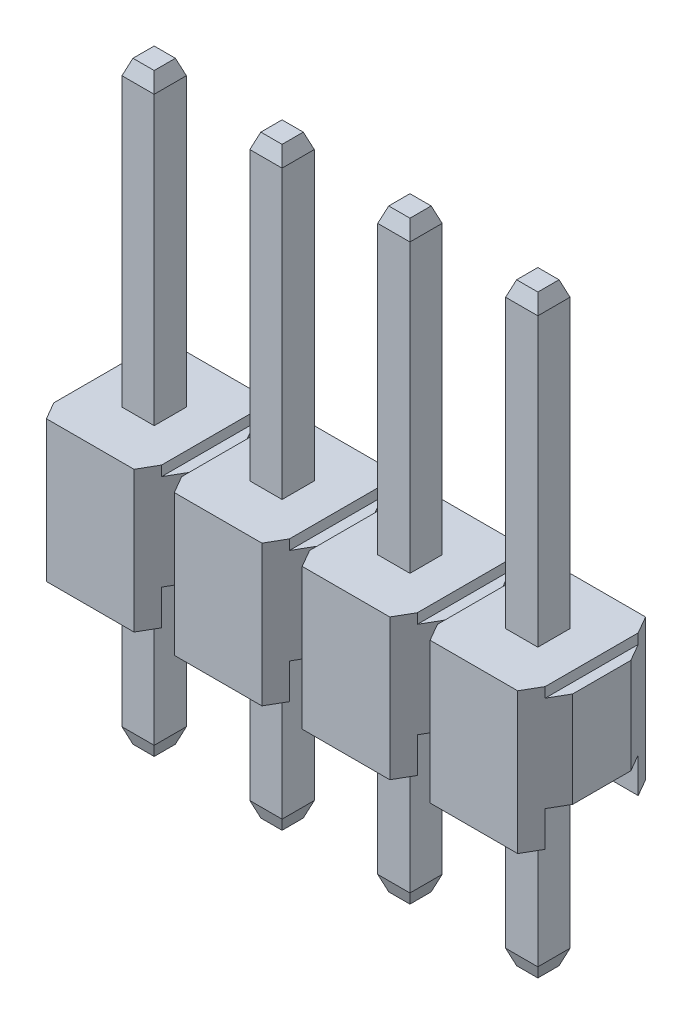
from build123d import *
from OCP.BRepFilletAPI import BRepFilletAPI_MakeChamfer

# Parameters (mm, degrees)
EXTRUDE_2_DEPTH                     = 2.8
SKETCH_3_W                          = 1.847179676
SKETCH_3_H                          = 0.7
CUT_EXTRUDE_1_DEPTH                 = 1.27
SKETCH_4_W                          = 0.2
SKETCH_4_H                          = 0.2
CUT_EXTRUDE_2_DEPTH                 = 4.326529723
EXTRUDE_START                       = -3
SKETCH_1_W                          = 0.64
SKETCH_1_H                          = 0.64
EXTRUDE_1_DEPTH                     = 11.8
CHAMFER_1_SIZE                      = 0.3
CHAMFER_1_SIZE2                     = 0.10919107
CHAMFER_2_SIZE                      = 0.11
CHAMFER_2_SIZE2                     = 0.302222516
PATTERN_LINEAR_1_COUNT              = 4
PATTERN_LINEAR_1_PITCH              = 2.54
PATTERN_LINEAR_2_COUNT              = 100
PATTERN_LINEAR_2_PITCH              = 2.54
CHAMFER_1_OF_PATTERN_LINEAR_2_SIZE  = 0.3
CHAMFER_1_OF_PATTERN_LINEAR_2_SIZE2 = 0.10919107
CHAMFER_2_OF_PATTERN_LINEAR_2_SIZE2 = 0.11
CHAMFER_2_OF_PATTERN_LINEAR_2_SIZE  = 0.302222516


with BuildPart() as part:
    # Sketch 2 → Extrude 2 (new body)
    with BuildSketch(Plane(origin=(0, 0, 0), x_dir=(1, 0, 0), z_dir=(0, 1, 0))):
        Polygon((-1.27, 0.577179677), (-0.87, 1.27), (0.87, 1.27), (1.27, 0.577179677), (1.27, -0.577179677), (0.87, -1.27), (-0.87, -1.27), (-1.27, -0.577179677), align=None)
    extrude_2 = extrude(amount=EXTRUDE_2_DEPTH)

    # Sketch 3 → Cut-Extrude 1 (cut, symmetric)
    with BuildSketch(Plane(origin=(0, 0, 0), x_dir=(0, 0, -1), z_dir=(1, 0, 0))):
        with Locations((0, 0.35)):
            Rectangle(SKETCH_3_W, SKETCH_3_H)
    cut_extrude_1 = extrude(amount=CUT_EXTRUDE_1_DEPTH, both=True, mode=Mode.SUBTRACT)

    # Sketch 4 → Cut-Extrude 2 (cut, symmetric)
    with BuildSketch(Plane.XY):
        with Locations((-1.17, 2.7)):
            Rectangle(SKETCH_4_W, SKETCH_4_H)
        with Locations((1.17, 2.7)):
            Rectangle(SKETCH_4_W, SKETCH_4_H)
    cut_extrude_2 = extrude(amount=CUT_EXTRUDE_2_DEPTH, both=True, mode=Mode.SUBTRACT)

    # Sketch 1 → Extrude 1 (add)
    with BuildSketch(Plane(origin=(0, 0, 0), x_dir=(1, 0, 0), z_dir=(0, 1, 0)).offset(EXTRUDE_START)):
        Rectangle(SKETCH_1_W, SKETCH_1_H)
    extrude_1 = extrude(amount=EXTRUDE_1_DEPTH)

    # Chamfer 1: one chamfer whose edges measure the first distance from different faces: ONE call of the kernel's chamfer builder (chamfer() names one face for all edges)
    chamfer_1_edges_1 = [part.edges().sort_by_distance(p)[0] for p in [
        (-0.32, 8.8, 0),
    ]]
    chamfer_1_side_1 = [part.faces().sort_by_distance(p)[0] for p in [
        (-0.32, 5.8, 0),
    ]]
    chamfer_1_edges_2 = [part.edges().sort_by_distance(p)[0] for p in [
        (0, 8.8, 0.32),
    ]]
    chamfer_1_side_2 = [part.faces().sort_by_distance(p)[0] for p in [
        (0, 5.8, 0.32),
    ]]
    chamfer_1_edges_3 = [part.edges().sort_by_distance(p)[0] for p in [
        (0.32, 8.8, 0),
    ]]
    chamfer_1_side_3 = [part.faces().sort_by_distance(p)[0] for p in [
        (0.32, 5.8, 0),
    ]]
    chamfer_1_edges_4 = [part.edges().sort_by_distance(p)[0] for p in [
        (0, 8.8, -0.32),
    ]]
    chamfer_1_side_4 = [part.faces().sort_by_distance(p)[0] for p in [
        (0, 5.8, -0.32),
    ]]
    chamfer_1 = BRepFilletAPI_MakeChamfer(part.part.solid().wrapped)
    for e in chamfer_1_edges_1:
        chamfer_1.Add(CHAMFER_1_SIZE, CHAMFER_1_SIZE2, e.wrapped, chamfer_1_side_1[0].wrapped)  # the first distance lies on this face
    for e in chamfer_1_edges_2:
        chamfer_1.Add(CHAMFER_1_SIZE, CHAMFER_1_SIZE2, e.wrapped, chamfer_1_side_2[0].wrapped)  # the first distance lies on this face
    for e in chamfer_1_edges_3:
        chamfer_1.Add(CHAMFER_1_SIZE, CHAMFER_1_SIZE2, e.wrapped, chamfer_1_side_3[0].wrapped)  # the first distance lies on this face
    for e in chamfer_1_edges_4:
        chamfer_1.Add(CHAMFER_1_SIZE, CHAMFER_1_SIZE2, e.wrapped, chamfer_1_side_4[0].wrapped)  # the first distance lies on this face
    add(Compound.cast(chamfer_1.Shape()), mode=Mode.REPLACE)

    # Chamfer 2
    chamfer_2_edges = [part.edges().sort_by_distance(p)[0] for p in [
        (-0.32, -3, 0),
        (0, -3, 0.32),
        (0.32, -3, 0),
        (0, -3, -0.32),
    ]]
    chamfer_2_side = [part.faces().sort_by_distance(p)[0] for p in [
        (0, -3, 0),
    ]]
    chamfer(chamfer_2_edges, length=CHAMFER_2_SIZE, length2=CHAMFER_2_SIZE2, reference=chamfer_2_side[0])

    # Pattern Linear 1: Extrude 2, Cut-Extrude 1, Cut-Extrude 2 ×4
    with Locations(*[(-i * PATTERN_LINEAR_1_PITCH, 0, 0) for i in range(1, PATTERN_LINEAR_1_COUNT)]):
        add(extrude_2)
        add(cut_extrude_1, mode=Mode.SUBTRACT)
        add(cut_extrude_2, mode=Mode.SUBTRACT)

    # Pattern Linear 2: Extrude 1 ×100, 96 skipped
    with Locations(*[(-i * PATTERN_LINEAR_2_PITCH, 0, 0) for i in range(1, PATTERN_LINEAR_2_COUNT) if i not in (4, 5, 6, 7, 8, 9, 10, 11, 12, 13, 14, 15, 16, 17, 18, 19, 20, 21, 22, 23, 24, 25, 26, 27, 28, 29, 30, 31, 32, 33, 34, 35, 36, 37, 38, 39, 40, 41, 42, 43, 44, 45, 46, 47, 48, 49, 50, 51, 52, 53, 54, 55, 56, 57, 58, 59, 60, 61, 62, 63, 64, 65, 66, 67, 68, 69, 70, 71, 72, 73, 74, 75, 76, 77, 78, 79, 80, 81, 82, 83, 84, 85, 86, 87, 88, 89, 90, 91, 92, 93, 94, 95, 96, 97, 98, 99)]):
        add(extrude_1)

    # Chamfer 1 of Pattern Linear 2: one chamfer whose edges measure the first distance from different faces: ONE call of the kernel's chamfer builder (chamfer() names one face for all edges)
    chamfer_1_of_pattern_linear_2_edges_1 = [part.edges().sort_by_distance(p)[0] for p in [
        (-2.86, 8.8, 0),
    ]]
    chamfer_1_of_pattern_linear_2_side_1 = [part.faces().sort_by_distance(p)[0] for p in [
        (-2.86, 5.8, 0),
    ]]
    chamfer_1_of_pattern_linear_2_edges_2 = [part.edges().sort_by_distance(p)[0] for p in [
        (-2.54, 8.8, 0.32),
    ]]
    chamfer_1_of_pattern_linear_2_side_2 = [part.faces().sort_by_distance(p)[0] for p in [
        (-2.54, 5.8, 0.32),
    ]]
    chamfer_1_of_pattern_linear_2_edges_3 = [part.edges().sort_by_distance(p)[0] for p in [
        (-2.22, 8.8, 0),
    ]]
    chamfer_1_of_pattern_linear_2_side_3 = [part.faces().sort_by_distance(p)[0] for p in [
        (-2.22, 5.8, 0),
    ]]
    chamfer_1_of_pattern_linear_2_edges_4 = [part.edges().sort_by_distance(p)[0] for p in [
        (-2.54, 8.8, -0.32),
    ]]
    chamfer_1_of_pattern_linear_2_side_4 = [part.faces().sort_by_distance(p)[0] for p in [
        (-2.54, 5.8, -0.32),
    ]]
    chamfer_1_of_pattern_linear_2_edges_5 = [part.edges().sort_by_distance(p)[0] for p in [
        (-5.4, 8.8, 0),
    ]]
    chamfer_1_of_pattern_linear_2_side_5 = [part.faces().sort_by_distance(p)[0] for p in [
        (-5.4, 5.8, 0),
    ]]
    chamfer_1_of_pattern_linear_2_edges_6 = [part.edges().sort_by_distance(p)[0] for p in [
        (-5.08, 8.8, 0.32),
    ]]
    chamfer_1_of_pattern_linear_2_side_6 = [part.faces().sort_by_distance(p)[0] for p in [
        (-5.08, 5.8, 0.32),
    ]]
    chamfer_1_of_pattern_linear_2_edges_7 = [part.edges().sort_by_distance(p)[0] for p in [
        (-4.76, 8.8, 0),
    ]]
    chamfer_1_of_pattern_linear_2_side_7 = [part.faces().sort_by_distance(p)[0] for p in [
        (-4.76, 5.8, 0),
    ]]
    chamfer_1_of_pattern_linear_2_edges_8 = [part.edges().sort_by_distance(p)[0] for p in [
        (-5.08, 8.8, -0.32),
    ]]
    chamfer_1_of_pattern_linear_2_side_8 = [part.faces().sort_by_distance(p)[0] for p in [
        (-5.08, 5.8, -0.32),
    ]]
    chamfer_1_of_pattern_linear_2_edges_9 = [part.edges().sort_by_distance(p)[0] for p in [
        (-7.94, 8.8, 0),
    ]]
    chamfer_1_of_pattern_linear_2_side_9 = [part.faces().sort_by_distance(p)[0] for p in [
        (-7.94, 5.8, 0),
    ]]
    chamfer_1_of_pattern_linear_2_edges_10 = [part.edges().sort_by_distance(p)[0] for p in [
        (-7.62, 8.8, 0.32),
    ]]
    chamfer_1_of_pattern_linear_2_side_10 = [part.faces().sort_by_distance(p)[0] for p in [
        (-7.62, 5.8, 0.32),
    ]]
    chamfer_1_of_pattern_linear_2_edges_11 = [part.edges().sort_by_distance(p)[0] for p in [
        (-7.3, 8.8, 0),
    ]]
    chamfer_1_of_pattern_linear_2_side_11 = [part.faces().sort_by_distance(p)[0] for p in [
        (-7.3, 5.8, 0),
    ]]
    chamfer_1_of_pattern_linear_2_edges_12 = [part.edges().sort_by_distance(p)[0] for p in [
        (-7.62, 8.8, -0.32),
    ]]
    chamfer_1_of_pattern_linear_2_side_12 = [part.faces().sort_by_distance(p)[0] for p in [
        (-7.62, 5.8, -0.32),
    ]]
    chamfer_1_of_pattern_linear_2 = BRepFilletAPI_MakeChamfer(part.part.solid().wrapped)
    for e in chamfer_1_of_pattern_linear_2_edges_1:
        chamfer_1_of_pattern_linear_2.Add(CHAMFER_1_OF_PATTERN_LINEAR_2_SIZE, CHAMFER_1_OF_PATTERN_LINEAR_2_SIZE2, e.wrapped, chamfer_1_of_pattern_linear_2_side_1[0].wrapped)  # the first distance lies on this face
    for e in chamfer_1_of_pattern_linear_2_edges_2:
        chamfer_1_of_pattern_linear_2.Add(CHAMFER_1_OF_PATTERN_LINEAR_2_SIZE, CHAMFER_1_OF_PATTERN_LINEAR_2_SIZE2, e.wrapped, chamfer_1_of_pattern_linear_2_side_2[0].wrapped)  # the first distance lies on this face
    for e in chamfer_1_of_pattern_linear_2_edges_3:
        chamfer_1_of_pattern_linear_2.Add(CHAMFER_1_OF_PATTERN_LINEAR_2_SIZE, CHAMFER_1_OF_PATTERN_LINEAR_2_SIZE2, e.wrapped, chamfer_1_of_pattern_linear_2_side_3[0].wrapped)  # the first distance lies on this face
    for e in chamfer_1_of_pattern_linear_2_edges_4:
        chamfer_1_of_pattern_linear_2.Add(CHAMFER_1_OF_PATTERN_LINEAR_2_SIZE, CHAMFER_1_OF_PATTERN_LINEAR_2_SIZE2, e.wrapped, chamfer_1_of_pattern_linear_2_side_4[0].wrapped)  # the first distance lies on this face
    for e in chamfer_1_of_pattern_linear_2_edges_5:
        chamfer_1_of_pattern_linear_2.Add(CHAMFER_1_OF_PATTERN_LINEAR_2_SIZE, CHAMFER_1_OF_PATTERN_LINEAR_2_SIZE2, e.wrapped, chamfer_1_of_pattern_linear_2_side_5[0].wrapped)  # the first distance lies on this face
    for e in chamfer_1_of_pattern_linear_2_edges_6:
        chamfer_1_of_pattern_linear_2.Add(CHAMFER_1_OF_PATTERN_LINEAR_2_SIZE, CHAMFER_1_OF_PATTERN_LINEAR_2_SIZE2, e.wrapped, chamfer_1_of_pattern_linear_2_side_6[0].wrapped)  # the first distance lies on this face
    for e in chamfer_1_of_pattern_linear_2_edges_7:
        chamfer_1_of_pattern_linear_2.Add(CHAMFER_1_OF_PATTERN_LINEAR_2_SIZE, CHAMFER_1_OF_PATTERN_LINEAR_2_SIZE2, e.wrapped, chamfer_1_of_pattern_linear_2_side_7[0].wrapped)  # the first distance lies on this face
    for e in chamfer_1_of_pattern_linear_2_edges_8:
        chamfer_1_of_pattern_linear_2.Add(CHAMFER_1_OF_PATTERN_LINEAR_2_SIZE, CHAMFER_1_OF_PATTERN_LINEAR_2_SIZE2, e.wrapped, chamfer_1_of_pattern_linear_2_side_8[0].wrapped)  # the first distance lies on this face
    for e in chamfer_1_of_pattern_linear_2_edges_9:
        chamfer_1_of_pattern_linear_2.Add(CHAMFER_1_OF_PATTERN_LINEAR_2_SIZE, CHAMFER_1_OF_PATTERN_LINEAR_2_SIZE2, e.wrapped, chamfer_1_of_pattern_linear_2_side_9[0].wrapped)  # the first distance lies on this face
    for e in chamfer_1_of_pattern_linear_2_edges_10:
        chamfer_1_of_pattern_linear_2.Add(CHAMFER_1_OF_PATTERN_LINEAR_2_SIZE, CHAMFER_1_OF_PATTERN_LINEAR_2_SIZE2, e.wrapped, chamfer_1_of_pattern_linear_2_side_10[0].wrapped)  # the first distance lies on this face
    for e in chamfer_1_of_pattern_linear_2_edges_11:
        chamfer_1_of_pattern_linear_2.Add(CHAMFER_1_OF_PATTERN_LINEAR_2_SIZE, CHAMFER_1_OF_PATTERN_LINEAR_2_SIZE2, e.wrapped, chamfer_1_of_pattern_linear_2_side_11[0].wrapped)  # the first distance lies on this face
    for e in chamfer_1_of_pattern_linear_2_edges_12:
        chamfer_1_of_pattern_linear_2.Add(CHAMFER_1_OF_PATTERN_LINEAR_2_SIZE, CHAMFER_1_OF_PATTERN_LINEAR_2_SIZE2, e.wrapped, chamfer_1_of_pattern_linear_2_side_12[0].wrapped)  # the first distance lies on this face
    add(Compound.cast(chamfer_1_of_pattern_linear_2.Shape()), mode=Mode.REPLACE)

    # Chamfer 2 of Pattern Linear 2
    chamfer_2_of_pattern_linear_2_edges = [part.edges().sort_by_distance(p)[0] for p in [
        (-2.86, -3, 0),
        (-2.54, -3, 0.32),
        (-2.22, -3, 0),
        (-2.54, -3, -0.32),
        (-5.4, -3, 0),
        (-5.08, -3, 0.32),
        (-4.76, -3, 0),
        (-5.08, -3, -0.32),
        (-7.94, -3, 0),
        (-7.62, -3, 0.32),
        (-7.3, -3, 0),
        (-7.62, -3, -0.32),
    ]]
    chamfer(chamfer_2_of_pattern_linear_2_edges, length=CHAMFER_2_OF_PATTERN_LINEAR_2_SIZE, length2=CHAMFER_2_OF_PATTERN_LINEAR_2_SIZE2)


solid = part.part
